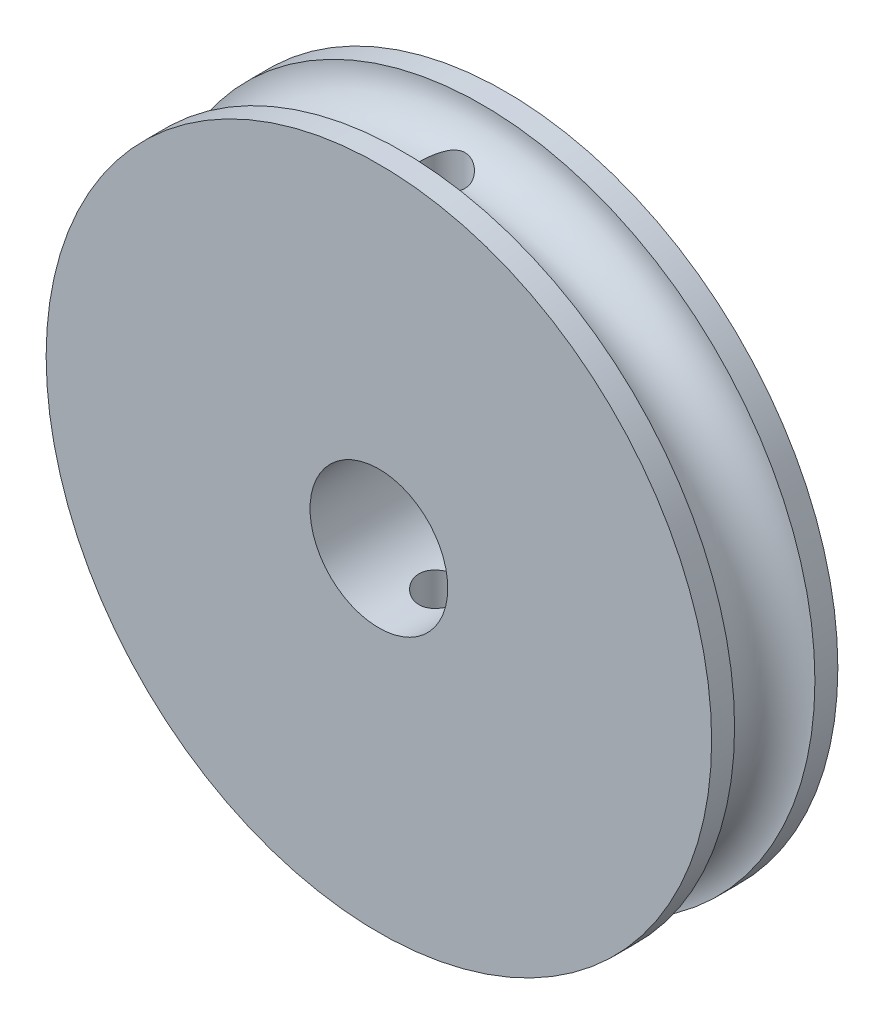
from build123d import *

# Parameters (mm, degrees)
ESQUISSE2_R                  = 14.5
ESQUISSE2_R_2                = 3
BOSS_EXTRU_1_DEPTH           = 5.5
ESQUISSE3_R                  = 1.75
ENL_V_MAT_EXTRU_1_DEPTH      = 22.230873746
ENL_V_MAT_EXTRU_1_DEPTH_BACK = 22.230873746
ESQUISSE4_R                  = 1
ESQUISSE5_R                  = 1
ENL_V_MAT_EXTRU_2_DEPTH      = 2


with BuildPart() as part:
    # Esquisse2 → Boss.-Extru.1 (new body)
    with BuildSketch(Plane.XY):
        Circle(ESQUISSE2_R)
        Circle(ESQUISSE2_R_2, mode=Mode.SUBTRACT)
    extrude(amount=BOSS_EXTRU_1_DEPTH)

    # Esquisse3 → Enl_vement de mati_re-R_volution1 (revolve, cut)
    with BuildSketch(Plane(origin=(0, 0, 0), x_dir=(0, 0, -1), z_dir=(1, 0, 0)), mode=Mode.PRIVATE) as enl_vement_de_mati_re_r_volution1_sk:
        with Locations((-2.75, 14.5)):
            Circle(ESQUISSE3_R)
    revolve(enl_vement_de_mati_re_r_volution1_sk.sketch.rotate(Axis((0, 0, 0), (0, 0, 1)), 90), axis=Axis((0, 0, 0), (0, 0, 1)), mode=Mode.SUBTRACT)

    # Esquisse4 → Enl_v. mat.-Extru.1 (cut, two sides: drawn at the far end of the back side and taken through both)
    with BuildSketch(Plane(origin=(0, 0, 0), x_dir=(1, 0, 0), z_dir=(0, 1, 0)).offset(-ENL_V_MAT_EXTRU_1_DEPTH_BACK)):
        with Locations(Location((0, -2.75, 0), (0, 0, 270))):
            Circle(ESQUISSE4_R)
    extrude(amount=ENL_V_MAT_EXTRU_1_DEPTH + ENL_V_MAT_EXTRU_1_DEPTH_BACK, mode=Mode.SUBTRACT)

    # Esquisse5 → Enl_v. mat.-Extru.2 (cut)
    with BuildSketch(Plane(origin=(0, 0, 0), x_dir=(-1, 0, 0), z_dir=(0, 0, -1))):
        with Locations((0, 8)):
            Circle(ESQUISSE5_R)
        with Locations(Location((0, -8, 0), (0, 0, 311.409622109))):
            Circle(ESQUISSE5_R)
    extrude(amount=-ENL_V_MAT_EXTRU_2_DEPTH, mode=Mode.SUBTRACT)


solid = part.part
